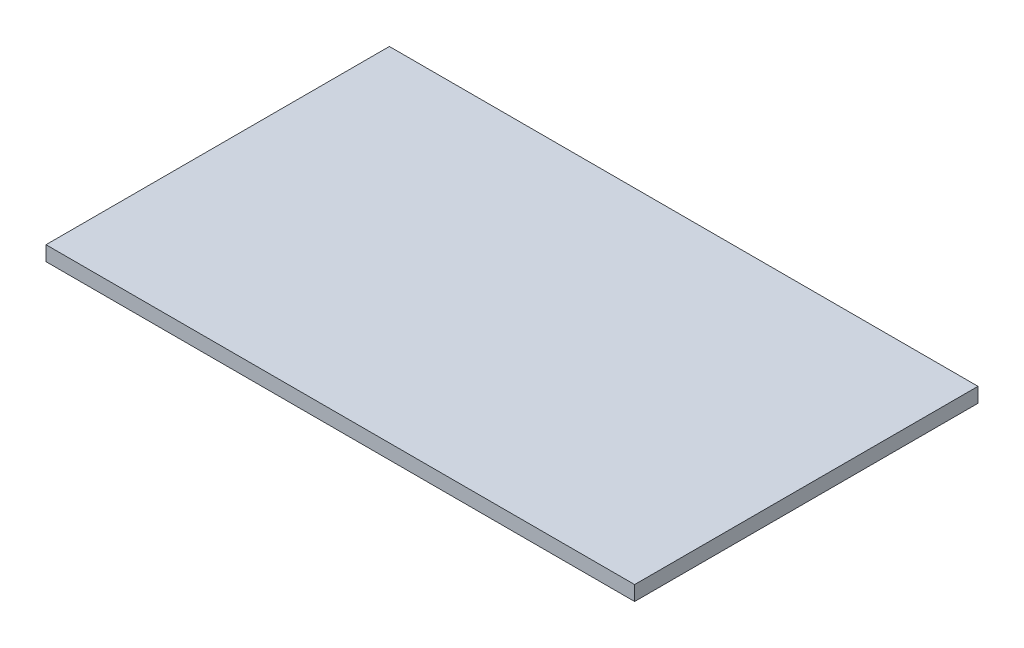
from build123d import *

# Parameters (mm, degrees)
ESQUISSE1_W      = 1200
ESQUISSE1_H      = 700
EXTRUSION1_DEPTH = 30


with BuildPart() as part:
    # Esquisse1 → Extrusion1 (new body)
    with BuildSketch(Plane(origin=(0, 0, 0), x_dir=(1, 0, 0), z_dir=(0, 1, 0))):
        with Locations((600, 350)):
            Rectangle(ESQUISSE1_W, ESQUISSE1_H)
    extrude(amount=EXTRUSION1_DEPTH)


solid = part.part
